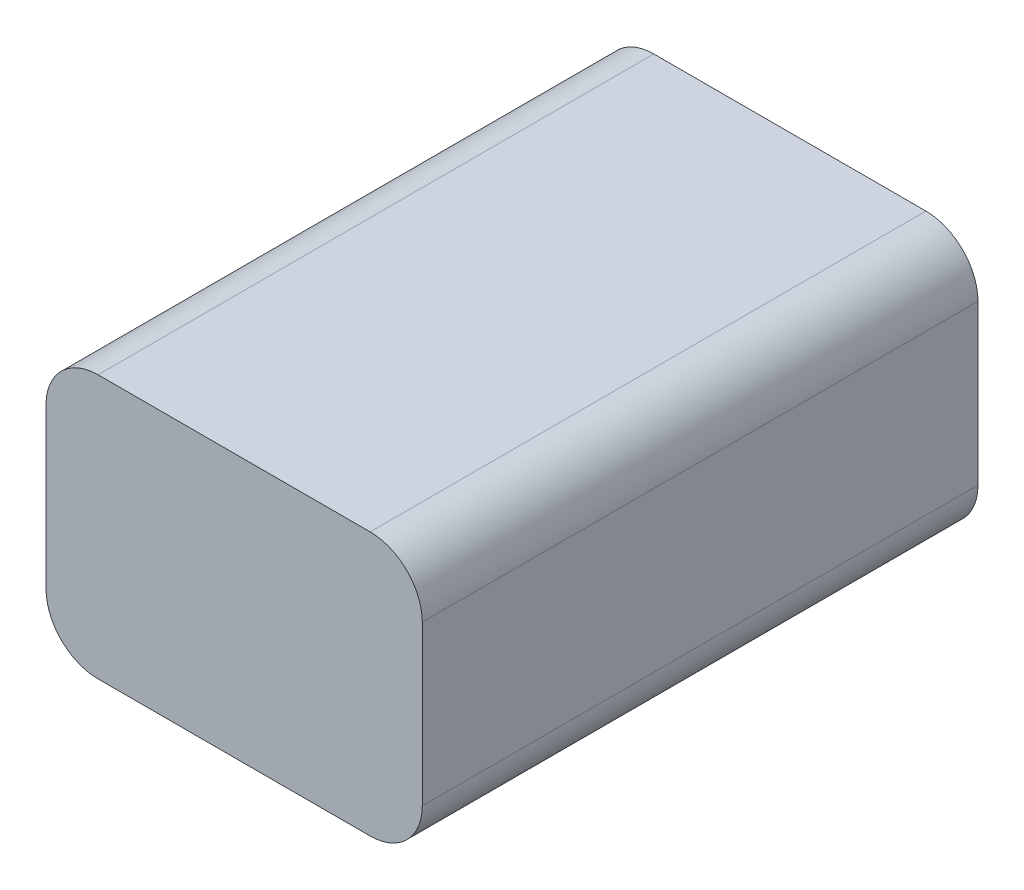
ISO-10303-21;
HEADER;
FILE_DESCRIPTION(('STEP AP214'),'2;1');
FILE_NAME('part.step','',(''),(''),'','','');
FILE_SCHEMA(('AUTOMOTIVE_DESIGN { 1 0 10303 214 1 1 1 1 }'));
ENDSEC;
DATA;
#1=APPLICATION_CONTEXT('core data for automotive mechanical design processes');
#2=APPLICATION_PROTOCOL_DEFINITION('international standard','automotive_design',2000,#1);
#3=PRODUCT_CONTEXT('',#1,'mechanical');
#4=PRODUCT('Part','Part','',(#3));
#5=PRODUCT_RELATED_PRODUCT_CATEGORY('part','',(#4));
#6=PRODUCT_DEFINITION_FORMATION('','',#4);
#7=PRODUCT_DEFINITION_CONTEXT('part definition',#1,'design');
#8=PRODUCT_DEFINITION('design','',#6,#7);
#9=PRODUCT_DEFINITION_SHAPE('','',#8);
#10=(LENGTH_UNIT() NAMED_UNIT(*) SI_UNIT(.MILLI.,.METRE.));
#11=(NAMED_UNIT(*) PLANE_ANGLE_UNIT() SI_UNIT($,.RADIAN.));
#12=(NAMED_UNIT(*) SI_UNIT($,.STERADIAN.) SOLID_ANGLE_UNIT());
#13=UNCERTAINTY_MEASURE_WITH_UNIT(LENGTH_MEASURE(1.E-05),#10,'distance_accuracy_value','');
#14=(GEOMETRIC_REPRESENTATION_CONTEXT(3) GLOBAL_UNCERTAINTY_ASSIGNED_CONTEXT((#13)) GLOBAL_UNIT_ASSIGNED_CONTEXT((#10,
#11,#12)) REPRESENTATION_CONTEXT('',''));
#15=CARTESIAN_POINT('',(0.,0.,0.));
#16=DIRECTION('',(0.,0.,1.));
#17=DIRECTION('',(1.,0.,0.));
#18=AXIS2_PLACEMENT_3D('',#15,#16,#17);
#19=CARTESIAN_POINT('',(-16.25,11.375,-24.));
#20=DIRECTION('',(-1.,0.,0.));
#21=DIRECTION('',(0.,0.,1.));
#22=AXIS2_PLACEMENT_3D('',#19,#20,#21);
#23=PLANE('',#22);
#24=DIRECTION('',(0.,-1.,0.));
#25=VECTOR('',#24,1.);
#26=CARTESIAN_POINT('',(-16.25,11.375,-24.));
#27=LINE('',#26,#25);
#28=CARTESIAN_POINT('',(-16.25,6.875,-24.));
#29=VERTEX_POINT('',#28);
#30=CARTESIAN_POINT('',(-16.25,-6.875,-24.));
#31=VERTEX_POINT('',#30);
#32=EDGE_CURVE('E146',#29,#31,#27,.T.);
#33=ORIENTED_EDGE('',*,*,#32,.T.);
#34=DIRECTION('',(0.,0.,1.));
#35=VECTOR('',#34,1.);
#36=CARTESIAN_POINT('',(-16.25,-6.875,-24.));
#37=LINE('',#36,#35);
#38=CARTESIAN_POINT('',(-16.25,-6.875,24.));
#39=VERTEX_POINT('',#38);
#40=EDGE_CURVE('E142',#31,#39,#37,.T.);
#41=ORIENTED_EDGE('',*,*,#40,.T.);
#42=DIRECTION('',(0.,-1.,0.));
#43=VECTOR('',#42,1.);
#44=CARTESIAN_POINT('',(-16.25,11.375,24.));
#45=LINE('',#44,#43);
#46=CARTESIAN_POINT('',(-16.25,6.875,24.));
#47=VERTEX_POINT('',#46);
#48=EDGE_CURVE('E97',#47,#39,#45,.T.);
#49=ORIENTED_EDGE('',*,*,#48,.F.);
#50=DIRECTION('',(0.,0.,1.));
#51=VECTOR('',#50,1.);
#52=CARTESIAN_POINT('',(-16.25,6.875,-24.));
#53=LINE('',#52,#51);
#54=EDGE_CURVE('E140',#47,#29,#53,.F.);
#55=ORIENTED_EDGE('',*,*,#54,.T.);
#56=EDGE_LOOP('',(#33,#41,#49,#55));
#57=FACE_BOUND('',#56,.T.);
#58=ADVANCED_FACE('F27',(#57),#23,.T.);
#59=CARTESIAN_POINT('',(-16.25,11.375,-24.));
#60=DIRECTION('',(0.,1.,0.));
#61=DIRECTION('',(0.,0.,1.));
#62=AXIS2_PLACEMENT_3D('',#59,#60,#61);
#63=PLANE('',#62);
#64=DIRECTION('',(-1.,0.,0.));
#65=VECTOR('',#64,1.);
#66=CARTESIAN_POINT('',(-16.25,11.375,-24.));
#67=LINE('',#66,#65);
#68=CARTESIAN_POINT('',(11.75,11.375,-24.));
#69=VERTEX_POINT('',#68);
#70=CARTESIAN_POINT('',(-11.75,11.375,-24.));
#71=VERTEX_POINT('',#70);
#72=EDGE_CURVE('E118',#69,#71,#67,.T.);
#73=ORIENTED_EDGE('',*,*,#72,.T.);
#74=DIRECTION('',(0.,0.,1.));
#75=VECTOR('',#74,1.);
#76=CARTESIAN_POINT('',(-11.75,11.375,-24.));
#77=LINE('',#76,#75);
#78=CARTESIAN_POINT('',(-11.75,11.375,24.));
#79=VERTEX_POINT('',#78);
#80=EDGE_CURVE('E11',#71,#79,#77,.T.);
#81=ORIENTED_EDGE('',*,*,#80,.T.);
#82=DIRECTION('',(-1.,0.,0.));
#83=VECTOR('',#82,1.);
#84=CARTESIAN_POINT('',(-16.25,11.375,24.));
#85=LINE('',#84,#83);
#86=CARTESIAN_POINT('',(11.75,11.375,24.));
#87=VERTEX_POINT('',#86);
#88=EDGE_CURVE('E148',#87,#79,#85,.T.);
#89=ORIENTED_EDGE('',*,*,#88,.F.);
#90=DIRECTION('',(0.,0.,1.));
#91=VECTOR('',#90,1.);
#92=CARTESIAN_POINT('',(11.75,11.375,-24.));
#93=LINE('',#92,#91);
#94=EDGE_CURVE('E34',#87,#69,#93,.F.);
#95=ORIENTED_EDGE('',*,*,#94,.T.);
#96=EDGE_LOOP('',(#73,#81,#89,#95));
#97=FACE_BOUND('',#96,.T.);
#98=ADVANCED_FACE('F166',(#97),#63,.T.);
#99=CARTESIAN_POINT('',(16.25,11.375,-24.));
#100=DIRECTION('',(1.,0.,0.));
#101=DIRECTION('',(0.,0.,-1.));
#102=AXIS2_PLACEMENT_3D('',#99,#100,#101);
#103=PLANE('',#102);
#104=DIRECTION('',(0.,1.,0.));
#105=VECTOR('',#104,1.);
#106=CARTESIAN_POINT('',(16.25,11.375,24.));
#107=LINE('',#106,#105);
#108=CARTESIAN_POINT('',(16.25,-6.875,24.));
#109=VERTEX_POINT('',#108);
#110=CARTESIAN_POINT('',(16.25,6.875,24.));
#111=VERTEX_POINT('',#110);
#112=EDGE_CURVE('E113',#109,#111,#107,.T.);
#113=ORIENTED_EDGE('',*,*,#112,.F.);
#114=DIRECTION('',(0.,0.,1.));
#115=VECTOR('',#114,1.);
#116=CARTESIAN_POINT('',(16.25,-6.875,-24.));
#117=LINE('',#116,#115);
#118=CARTESIAN_POINT('',(16.25,-6.875,-24.));
#119=VERTEX_POINT('',#118);
#120=EDGE_CURVE('E132',#109,#119,#117,.F.);
#121=ORIENTED_EDGE('',*,*,#120,.T.);
#122=DIRECTION('',(0.,1.,0.));
#123=VECTOR('',#122,1.);
#124=CARTESIAN_POINT('',(16.25,11.375,-24.));
#125=LINE('',#124,#123);
#126=CARTESIAN_POINT('',(16.25,6.875,-24.));
#127=VERTEX_POINT('',#126);
#128=EDGE_CURVE('E122',#119,#127,#125,.T.);
#129=ORIENTED_EDGE('',*,*,#128,.T.);
#130=DIRECTION('',(0.,0.,1.));
#131=VECTOR('',#130,1.);
#132=CARTESIAN_POINT('',(16.25,6.875,-24.));
#133=LINE('',#132,#131);
#134=EDGE_CURVE('E129',#127,#111,#133,.T.);
#135=ORIENTED_EDGE('',*,*,#134,.T.);
#136=EDGE_LOOP('',(#113,#121,#129,#135));
#137=FACE_BOUND('',#136,.T.);
#138=ADVANCED_FACE('F159',(#137),#103,.T.);
#139=CARTESIAN_POINT('',(-16.25,-11.375,-24.));
#140=DIRECTION('',(0.,-1.,0.));
#141=DIRECTION('',(0.,0.,-1.));
#142=AXIS2_PLACEMENT_3D('',#139,#140,#141);
#143=PLANE('',#142);
#144=DIRECTION('',(1.,0.,0.));
#145=VECTOR('',#144,1.);
#146=CARTESIAN_POINT('',(-16.25,-11.375,-24.));
#147=LINE('',#146,#145);
#148=CARTESIAN_POINT('',(-11.75,-11.375,-24.));
#149=VERTEX_POINT('',#148);
#150=CARTESIAN_POINT('',(11.75,-11.375,-24.));
#151=VERTEX_POINT('',#150);
#152=EDGE_CURVE('E147',#149,#151,#147,.T.);
#153=ORIENTED_EDGE('',*,*,#152,.T.);
#154=DIRECTION('',(0.,0.,1.));
#155=VECTOR('',#154,1.);
#156=CARTESIAN_POINT('',(11.75,-11.375,-24.));
#157=LINE('',#156,#155);
#158=CARTESIAN_POINT('',(11.75,-11.375,24.));
#159=VERTEX_POINT('',#158);
#160=EDGE_CURVE('E112',#151,#159,#157,.T.);
#161=ORIENTED_EDGE('',*,*,#160,.T.);
#162=DIRECTION('',(1.,0.,0.));
#163=VECTOR('',#162,1.);
#164=CARTESIAN_POINT('',(-16.25,-11.375,24.));
#165=LINE('',#164,#163);
#166=CARTESIAN_POINT('',(-11.75,-11.375,24.));
#167=VERTEX_POINT('',#166);
#168=EDGE_CURVE('E95',#167,#159,#165,.T.);
#169=ORIENTED_EDGE('',*,*,#168,.F.);
#170=DIRECTION('',(0.,0.,1.));
#171=VECTOR('',#170,1.);
#172=CARTESIAN_POINT('',(-11.75,-11.375,-24.));
#173=LINE('',#172,#171);
#174=EDGE_CURVE('E109',#167,#149,#173,.F.);
#175=ORIENTED_EDGE('',*,*,#174,.T.);
#176=EDGE_LOOP('',(#153,#161,#169,#175));
#177=FACE_BOUND('',#176,.T.);
#178=ADVANCED_FACE('F108',(#177),#143,.T.);
#179=CARTESIAN_POINT('',(-16.25,-11.375,-24.));
#180=DIRECTION('',(0.,0.,1.));
#181=DIRECTION('',(1.,0.,0.));
#182=AXIS2_PLACEMENT_3D('',#179,#180,#181);
#183=PLANE('',#182);
#184=ORIENTED_EDGE('',*,*,#128,.F.);
#185=CARTESIAN_POINT('',(11.75,-6.875,-24.));
#186=DIRECTION('',(0.,0.,1.));
#187=DIRECTION('',(1.,0.,0.));
#188=AXIS2_PLACEMENT_3D('',#185,#186,#187);
#189=CIRCLE('',#188,4.5);
#190=EDGE_CURVE('E138',#119,#151,#189,.F.);
#191=ORIENTED_EDGE('',*,*,#190,.T.);
#192=ORIENTED_EDGE('',*,*,#152,.F.);
#193=CARTESIAN_POINT('',(-11.75,-6.875,-24.));
#194=DIRECTION('',(0.,0.,1.));
#195=DIRECTION('',(1.,0.,0.));
#196=AXIS2_PLACEMENT_3D('',#193,#194,#195);
#197=CIRCLE('',#196,4.5);
#198=EDGE_CURVE('E117',#149,#31,#197,.F.);
#199=ORIENTED_EDGE('',*,*,#198,.T.);
#200=ORIENTED_EDGE('',*,*,#32,.F.);
#201=CARTESIAN_POINT('',(-11.75,6.875,-24.));
#202=DIRECTION('',(0.,0.,1.));
#203=DIRECTION('',(1.,0.,0.));
#204=AXIS2_PLACEMENT_3D('',#201,#202,#203);
#205=CIRCLE('',#204,4.5);
#206=EDGE_CURVE('E41',#29,#71,#205,.F.);
#207=ORIENTED_EDGE('',*,*,#206,.T.);
#208=ORIENTED_EDGE('',*,*,#72,.F.);
#209=CARTESIAN_POINT('',(11.75,6.875,-24.));
#210=DIRECTION('',(0.,0.,1.));
#211=DIRECTION('',(1.,0.,0.));
#212=AXIS2_PLACEMENT_3D('',#209,#210,#211);
#213=CIRCLE('',#212,4.5);
#214=EDGE_CURVE('E134',#69,#127,#213,.F.);
#215=ORIENTED_EDGE('',*,*,#214,.T.);
#216=EDGE_LOOP('',(#184,#191,#192,#199,#200,#207,#208,#215));
#217=FACE_BOUND('',#216,.T.);
#218=ADVANCED_FACE('F189',(#217),#183,.F.);
#219=CARTESIAN_POINT('',(-16.25,-11.375,24.));
#220=DIRECTION('',(0.,0.,1.));
#221=DIRECTION('',(1.,0.,0.));
#222=AXIS2_PLACEMENT_3D('',#219,#220,#221);
#223=PLANE('',#222);
#224=ORIENTED_EDGE('',*,*,#168,.T.);
#225=CARTESIAN_POINT('',(11.75,-6.875,24.));
#226=DIRECTION('',(0.,0.,1.));
#227=DIRECTION('',(1.,0.,0.));
#228=AXIS2_PLACEMENT_3D('',#225,#226,#227);
#229=CIRCLE('',#228,4.5);
#230=EDGE_CURVE('E102',#159,#109,#229,.T.);
#231=ORIENTED_EDGE('',*,*,#230,.T.);
#232=ORIENTED_EDGE('',*,*,#112,.T.);
#233=CARTESIAN_POINT('',(11.75,6.875,24.));
#234=DIRECTION('',(0.,0.,1.));
#235=DIRECTION('',(1.,0.,0.));
#236=AXIS2_PLACEMENT_3D('',#233,#234,#235);
#237=CIRCLE('',#236,4.5);
#238=EDGE_CURVE('E120',#111,#87,#237,.T.);
#239=ORIENTED_EDGE('',*,*,#238,.T.);
#240=ORIENTED_EDGE('',*,*,#88,.T.);
#241=CARTESIAN_POINT('',(-11.75,6.875,24.));
#242=DIRECTION('',(0.,0.,1.));
#243=DIRECTION('',(1.,0.,0.));
#244=AXIS2_PLACEMENT_3D('',#241,#242,#243);
#245=CIRCLE('',#244,4.5);
#246=EDGE_CURVE('E103',#79,#47,#245,.T.);
#247=ORIENTED_EDGE('',*,*,#246,.T.);
#248=ORIENTED_EDGE('',*,*,#48,.T.);
#249=CARTESIAN_POINT('',(-11.75,-6.875,24.));
#250=DIRECTION('',(0.,0.,1.));
#251=DIRECTION('',(1.,0.,0.));
#252=AXIS2_PLACEMENT_3D('',#249,#250,#251);
#253=CIRCLE('',#252,4.5);
#254=EDGE_CURVE('E92',#39,#167,#253,.T.);
#255=ORIENTED_EDGE('',*,*,#254,.T.);
#256=EDGE_LOOP('',(#224,#231,#232,#239,#240,#247,#248,#255));
#257=FACE_BOUND('',#256,.T.);
#258=ADVANCED_FACE('F94',(#257),#223,.T.);
#259=CARTESIAN_POINT('',(11.75,-6.875,-24.));
#260=DIRECTION('',(0.,0.,1.));
#261=DIRECTION('',(1.,0.,0.));
#262=AXIS2_PLACEMENT_3D('',#259,#260,#261);
#263=CYLINDRICAL_SURFACE('',#262,4.5);
#264=ORIENTED_EDGE('',*,*,#190,.F.);
#265=ORIENTED_EDGE('',*,*,#120,.F.);
#266=ORIENTED_EDGE('',*,*,#230,.F.);
#267=ORIENTED_EDGE('',*,*,#160,.F.);
#268=EDGE_LOOP('',(#264,#265,#266,#267));
#269=FACE_BOUND('',#268,.T.);
#270=ADVANCED_FACE('F177',(#269),#263,.T.);
#271=CARTESIAN_POINT('',(-11.75,-6.875,-24.));
#272=DIRECTION('',(0.,0.,1.));
#273=DIRECTION('',(1.,0.,0.));
#274=AXIS2_PLACEMENT_3D('',#271,#272,#273);
#275=CYLINDRICAL_SURFACE('',#274,4.5);
#276=ORIENTED_EDGE('',*,*,#198,.F.);
#277=ORIENTED_EDGE('',*,*,#174,.F.);
#278=ORIENTED_EDGE('',*,*,#254,.F.);
#279=ORIENTED_EDGE('',*,*,#40,.F.);
#280=EDGE_LOOP('',(#276,#277,#278,#279));
#281=FACE_BOUND('',#280,.T.);
#282=ADVANCED_FACE('F116',(#281),#275,.T.);
#283=CARTESIAN_POINT('',(-11.75,6.875,-24.));
#284=DIRECTION('',(0.,0.,1.));
#285=DIRECTION('',(1.,0.,0.));
#286=AXIS2_PLACEMENT_3D('',#283,#284,#285);
#287=CYLINDRICAL_SURFACE('',#286,4.5);
#288=ORIENTED_EDGE('',*,*,#206,.F.);
#289=ORIENTED_EDGE('',*,*,#54,.F.);
#290=ORIENTED_EDGE('',*,*,#246,.F.);
#291=ORIENTED_EDGE('',*,*,#80,.F.);
#292=EDGE_LOOP('',(#288,#289,#290,#291));
#293=FACE_BOUND('',#292,.T.);
#294=ADVANCED_FACE('F169',(#293),#287,.T.);
#295=CARTESIAN_POINT('',(11.75,6.875,-24.));
#296=DIRECTION('',(0.,0.,1.));
#297=DIRECTION('',(1.,0.,0.));
#298=AXIS2_PLACEMENT_3D('',#295,#296,#297);
#299=CYLINDRICAL_SURFACE('',#298,4.5);
#300=ORIENTED_EDGE('',*,*,#214,.F.);
#301=ORIENTED_EDGE('',*,*,#94,.F.);
#302=ORIENTED_EDGE('',*,*,#238,.F.);
#303=ORIENTED_EDGE('',*,*,#134,.F.);
#304=EDGE_LOOP('',(#300,#301,#302,#303));
#305=FACE_BOUND('',#304,.T.);
#306=ADVANCED_FACE('F165',(#305),#299,.T.);
#307=CLOSED_SHELL('',(#58,#98,#138,#178,#218,#258,#270,#282,#294,#306));
#308=MANIFOLD_SOLID_BREP('B2',#307);
#309=ADVANCED_BREP_SHAPE_REPRESENTATION('',(#18,#308),#14);
#310=SHAPE_DEFINITION_REPRESENTATION(#9,#309);
ENDSEC;
END-ISO-10303-21;
